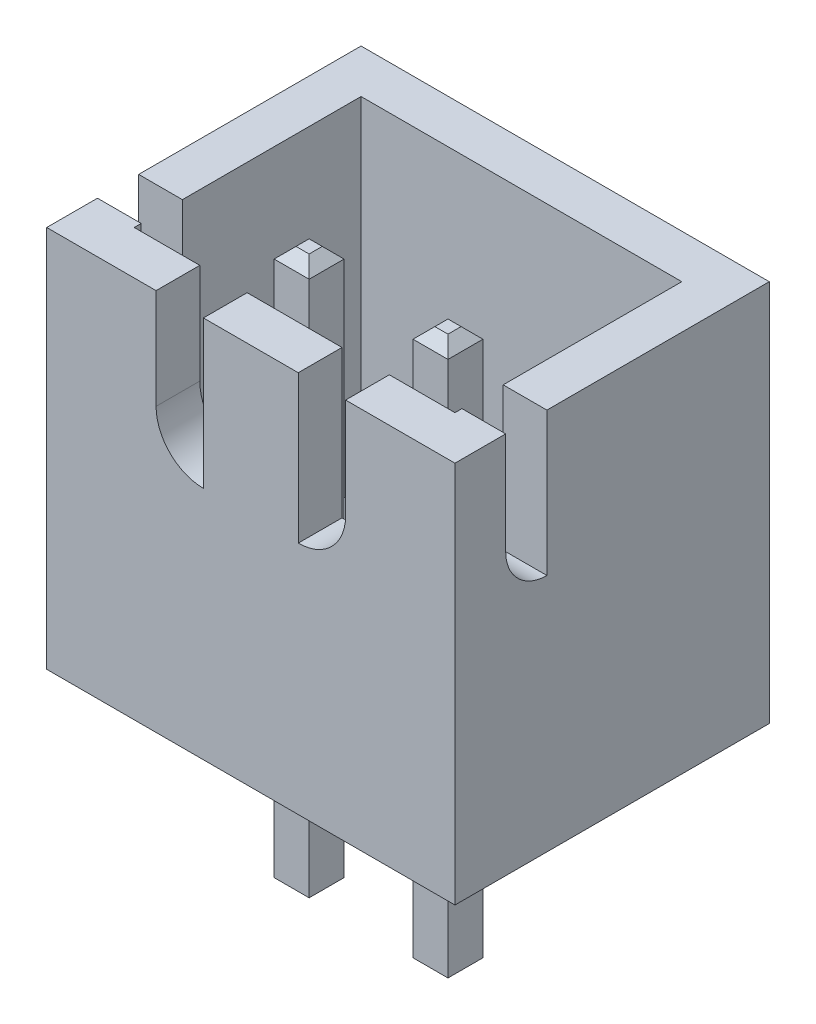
from build123d import *

# Parameters (mm, degrees)
SKETCH1_W                = 7.4676
SKETCH1_H                = 5.75
BOSS_EXTRUDE1_DEPTH      = 7
SHELL1_T                 = -0.8
CUT_EXTRUDE1_DEPTH       = 11.631588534
CUT_EXTRUDE2_REACH       = 11.798
BOSS_EXTRUDE2_DEPTH      = 3.45
BOSS_EXTRUDE2_DEPTH_BACK = 6.75
SKETCH4_W                = 0.64
SKETCH4_H                = 0.64
CHAMFER1_SIZE            = 0.2


with BuildPart() as part:
    # Sketch1 → Boss-Extrude1 (new body)
    with BuildSketch(Plane(origin=(0, 0, 0), x_dir=(1, 0, 0), z_dir=(0, 1, 0))):
        Rectangle(SKETCH1_W, SKETCH1_H)
    extrude(amount=BOSS_EXTRUDE1_DEPTH)

    # Shell1
    shell1_openings = [part.faces().sort_by_distance(p)[0] for p in [
        (0, 7, 0),
    ]]
    offset(amount=SHELL1_T, openings=shell1_openings, kind=Kind.INTERSECTION)

    # Sketch2 → Cut-Extrude1 (cut, through all)
    with BuildSketch(Plane(origin=(3.7338, 0, 0), x_dir=(0, 0, -1), z_dir=(1, 0, 0))):
        with BuildLine():
            Line((-1.19301282, 7), (-1.19301282, 4.379603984))
            ThreePointArc((-1.19301282, 4.379603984), (-1.72610374, 4.600417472), (-1.946917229, 5.133508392))
            Line((-1.946917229, 5.133508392), (-1.946917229, 7))
            Line((-1.946917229, 7), (-1.19301282, 7))
        make_face()
    extrude(amount=-CUT_EXTRUDE1_DEPTH, mode=Mode.SUBTRACT)

    # Sketch3 → Cut-Extrude2 (cut, up to next)
    with BuildSketch(Plane.XY.offset(2.875), mode=Mode.PRIVATE) as cut_extrude2_sk1:
        with BuildLine():
            Line((-1.7338, 7), (-1.7338, 6.728922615))
            Line((-1.7338, 6.728922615), (-1.7338, 5.166308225))
            ThreePointArc((-1.7338, 5.166308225), (-1.480086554, 4.553789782), (-0.86756811, 4.300076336))
            Line((-0.86756811, 4.300076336), (-0.86756811, 7))
            Line((-0.86756811, 7), (-1.7338, 7))
        make_face()
    cut_extrude2_tool1 = extrude(cut_extrude2_sk1.sketch, amount=-CUT_EXTRUDE2_REACH, mode=Mode.PRIVATE) & part.part
    # Sketch3 → Cut-Extrude2 (cut, up to next)
    with BuildSketch(Plane.XY.offset(2.875), mode=Mode.PRIVATE) as cut_extrude2_sk2:
        with BuildLine():
            Line((0.86756811, 7), (1.7338, 7))
            Line((1.7338, 7), (1.7338, 6.728922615))
            Line((1.7338, 6.728922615), (1.7338, 5.166308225))
            ThreePointArc((1.7338, 5.166308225), (1.480086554, 4.553789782), (0.86756811, 4.300076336))
            Line((0.86756811, 4.300076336), (0.86756811, 7))
        make_face()
    cut_extrude2_tool2 = extrude(cut_extrude2_sk2.sketch, amount=-CUT_EXTRUDE2_REACH, mode=Mode.PRIVATE) & part.part
    add(cut_extrude2_tool1.solids().sort_by_distance((-1.282965, 5.735551, 2.875))[0], mode=Mode.SUBTRACT)
    add(cut_extrude2_tool2.solids().sort_by_distance((1.282965, 5.735551, 2.875))[0], mode=Mode.SUBTRACT)

    # Sketch4 → Boss-Extrude2 (add, two sides: drawn at the far end of the back side and taken through both)
    with BuildSketch(Plane.XZ.offset(-BOSS_EXTRUDE2_DEPTH_BACK)):
        with Locations((-1.2838, 0.525)):
            Rectangle(SKETCH4_W, SKETCH4_H)
        with Locations((1.2562, 0.525)):
            Rectangle(SKETCH4_W, SKETCH4_H)
    extrude(amount=BOSS_EXTRUDE2_DEPTH + BOSS_EXTRUDE2_DEPTH_BACK)

    # Chamfer1
    chamfer1_edges = [part.edges().sort_by_distance(p)[0] for p in [
        (1.2562, 6.75, 0.205),
        (0.9362, 6.75, 0.525),
        (1.2562, 6.75, 0.845),
        (1.5762, 6.75, 0.525),
        (1.2562, -3.45, 0.205),
        (1.5762, -3.45, 0.525),
        (1.2562, -3.45, 0.845),
        (0.9362, -3.45, 0.525),
        (-0.9638, 6.75, 0.525),
        (-1.2838, 6.75, 0.205),
        (-1.6038, 6.75, 0.525),
        (-1.2838, 6.75, 0.845),
        (-0.9638, -3.45, 0.525),
        (-1.2838, -3.45, 0.845),
        (-1.6038, -3.45, 0.525),
        (-1.2838, -3.45, 0.205),
    ]]
    chamfer(chamfer1_edges, length=CHAMFER1_SIZE)


solid = part.part
